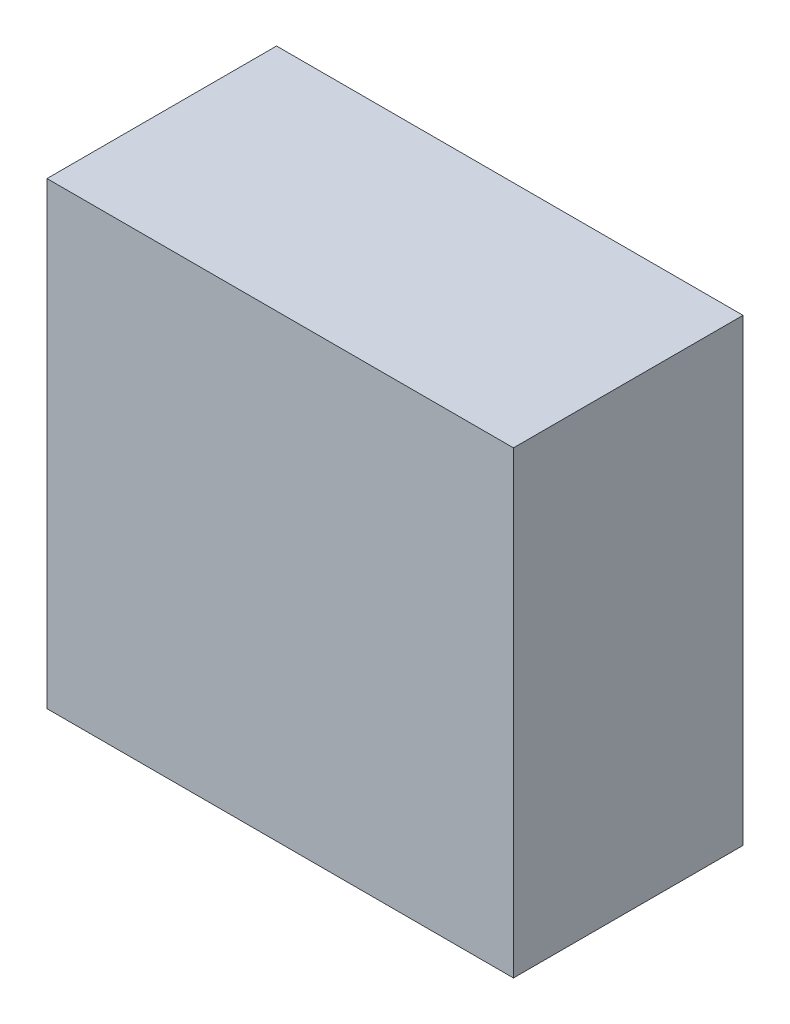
from build123d import *

# Parameters (mm, degrees)
SKETCH1_W           = 100
SKETCH1_H           = 200
BOSS_EXTRUDE1_DEPTH = 203.2


with BuildPart() as part:
    # Sketch1 → Boss-Extrude1 (new body)
    with BuildSketch(Plane(origin=(0, 0, 0), x_dir=(0, 0, -1), z_dir=(1, 0, 0))):
        Rectangle(SKETCH1_W, SKETCH1_H)
    extrude(amount=BOSS_EXTRUDE1_DEPTH)


solid = part.part
